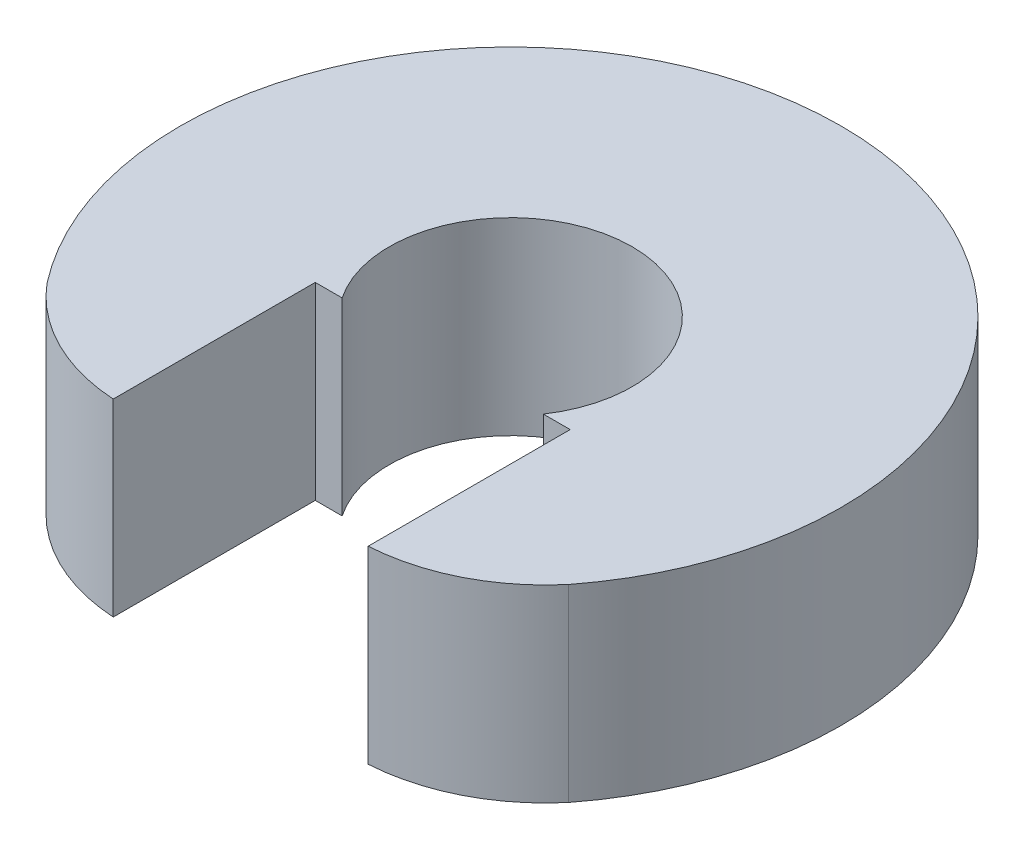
ISO-10303-21;
HEADER;
FILE_DESCRIPTION(('STEP AP214'),'2;1');
FILE_NAME('part.step','',(''),(''),'','','');
FILE_SCHEMA(('AUTOMOTIVE_DESIGN { 1 0 10303 214 1 1 1 1 }'));
ENDSEC;
DATA;
#1=APPLICATION_CONTEXT('core data for automotive mechanical design processes');
#2=APPLICATION_PROTOCOL_DEFINITION('international standard','automotive_design',2000,#1);
#3=PRODUCT_CONTEXT('',#1,'mechanical');
#4=PRODUCT('Part','Part','',(#3));
#5=PRODUCT_RELATED_PRODUCT_CATEGORY('part','',(#4));
#6=PRODUCT_DEFINITION_FORMATION('','',#4);
#7=PRODUCT_DEFINITION_CONTEXT('part definition',#1,'design');
#8=PRODUCT_DEFINITION('design','',#6,#7);
#9=PRODUCT_DEFINITION_SHAPE('','',#8);
#10=(LENGTH_UNIT() NAMED_UNIT(*) SI_UNIT(.MILLI.,.METRE.));
#11=(NAMED_UNIT(*) PLANE_ANGLE_UNIT() SI_UNIT($,.RADIAN.));
#12=(NAMED_UNIT(*) SI_UNIT($,.STERADIAN.) SOLID_ANGLE_UNIT());
#13=UNCERTAINTY_MEASURE_WITH_UNIT(LENGTH_MEASURE(1.E-05),#10,'distance_accuracy_value','');
#14=(GEOMETRIC_REPRESENTATION_CONTEXT(3) GLOBAL_UNCERTAINTY_ASSIGNED_CONTEXT((#13)) GLOBAL_UNIT_ASSIGNED_CONTEXT((#10,
#11,#12)) REPRESENTATION_CONTEXT('',''));
#15=CARTESIAN_POINT('',(0.,0.,0.));
#16=DIRECTION('',(0.,0.,1.));
#17=DIRECTION('',(1.,0.,0.));
#18=AXIS2_PLACEMENT_3D('',#15,#16,#17);
#19=CARTESIAN_POINT('',(0.,100.,0.));
#20=DIRECTION('',(0.,-1.,0.));
#21=DIRECTION('',(0.,0.,-1.));
#22=AXIS2_PLACEMENT_3D('',#19,#20,#21);
#23=CYLINDRICAL_SURFACE('',#22,175.);
#24=CARTESIAN_POINT('',(0.,0.,0.));
#25=DIRECTION('',(0.,1.,0.));
#26=DIRECTION('',(1.,0.,0.));
#27=AXIS2_PLACEMENT_3D('',#24,#25,#26);
#28=CIRCLE('',#27,175.);
#29=CARTESIAN_POINT('',(138.130006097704,0.,107.448133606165));
#30=VERTEX_POINT('',#29);
#31=CARTESIAN_POINT('',(-138.130006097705,0.,107.448133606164));
#32=VERTEX_POINT('',#31);
#33=EDGE_CURVE('E11',#30,#32,#28,.T.);
#34=ORIENTED_EDGE('',*,*,#33,.T.);
#35=DIRECTION('',(0.,-1.,0.));
#36=VECTOR('',#35,1.);
#37=CARTESIAN_POINT('',(-138.130006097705,100.,107.448133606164));
#38=LINE('',#37,#36);
#39=CARTESIAN_POINT('',(-138.130006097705,100.,107.448133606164));
#40=VERTEX_POINT('',#39);
#41=EDGE_CURVE('E39',#40,#32,#38,.T.);
#42=ORIENTED_EDGE('',*,*,#41,.F.);
#43=CARTESIAN_POINT('',(0.,100.,0.));
#44=DIRECTION('',(0.,1.,0.));
#45=DIRECTION('',(1.,0.,0.));
#46=AXIS2_PLACEMENT_3D('',#43,#44,#45);
#47=CIRCLE('',#46,175.);
#48=CARTESIAN_POINT('',(138.130006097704,100.,107.448133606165));
#49=VERTEX_POINT('',#48);
#50=EDGE_CURVE('E97',#49,#40,#47,.T.);
#51=ORIENTED_EDGE('',*,*,#50,.F.);
#52=DIRECTION('',(0.,-1.,0.));
#53=VECTOR('',#52,1.);
#54=CARTESIAN_POINT('',(138.130006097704,100.,107.448133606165));
#55=LINE('',#54,#53);
#56=EDGE_CURVE('E27',#49,#30,#55,.T.);
#57=ORIENTED_EDGE('',*,*,#56,.T.);
#58=EDGE_LOOP('',(#34,#42,#51,#57));
#59=FACE_BOUND('',#58,.T.);
#60=ADVANCED_FACE('F16',(#59),#23,.T.);
#61=CARTESIAN_POINT('',(-61.4364033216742,100.,43.0182327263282));
#62=DIRECTION('',(0.,-1.,0.));
#63=DIRECTION('',(0.,0.,-1.));
#64=AXIS2_PLACEMENT_3D('',#61,#62,#63);
#65=CYLINDRICAL_SURFACE('',#64,100.165467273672);
#66=CARTESIAN_POINT('',(-61.4364033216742,0.,43.0182327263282));
#67=DIRECTION('',(0.,1.,0.));
#68=DIRECTION('',(1.,0.,0.));
#69=AXIS2_PLACEMENT_3D('',#66,#67,#68);
#70=CIRCLE('',#69,100.165467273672);
#71=CARTESIAN_POINT('',(-67.5,0.,142.999999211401));
#72=VERTEX_POINT('',#71);
#73=EDGE_CURVE('E114',#32,#72,#70,.T.);
#74=ORIENTED_EDGE('',*,*,#73,.T.);
#75=DIRECTION('',(0.,-1.,0.));
#76=VECTOR('',#75,1.);
#77=CARTESIAN_POINT('',(-67.5,100.,142.999999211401));
#78=LINE('',#77,#76);
#79=CARTESIAN_POINT('',(-67.5,100.,142.999999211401));
#80=VERTEX_POINT('',#79);
#81=EDGE_CURVE('E139',#80,#72,#78,.T.);
#82=ORIENTED_EDGE('',*,*,#81,.F.);
#83=CARTESIAN_POINT('',(-61.4364033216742,100.,43.0182327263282));
#84=DIRECTION('',(0.,1.,0.));
#85=DIRECTION('',(1.,0.,0.));
#86=AXIS2_PLACEMENT_3D('',#83,#84,#85);
#87=CIRCLE('',#86,100.165467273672);
#88=EDGE_CURVE('E104',#40,#80,#87,.T.);
#89=ORIENTED_EDGE('',*,*,#88,.F.);
#90=ORIENTED_EDGE('',*,*,#41,.T.);
#91=EDGE_LOOP('',(#74,#82,#89,#90));
#92=FACE_BOUND('',#91,.T.);
#93=ADVANCED_FACE('F210',(#92),#65,.T.);
#94=CARTESIAN_POINT('',(-67.5,100.,142.999999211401));
#95=DIRECTION('',(-1.,0.,0.));
#96=DIRECTION('',(0.,0.,1.));
#97=AXIS2_PLACEMENT_3D('',#94,#95,#96);
#98=PLANE('',#97);
#99=DIRECTION('',(0.,0.,-1.));
#100=VECTOR('',#99,1.);
#101=CARTESIAN_POINT('',(-67.5,0.,142.999999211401));
#102=LINE('',#101,#100);
#103=CARTESIAN_POINT('',(-67.5,0.,36.));
#104=VERTEX_POINT('',#103);
#105=EDGE_CURVE('E140',#72,#104,#102,.T.);
#106=ORIENTED_EDGE('',*,*,#105,.T.);
#107=DIRECTION('',(0.,-1.,0.));
#108=VECTOR('',#107,1.);
#109=CARTESIAN_POINT('',(-67.5,100.,36.));
#110=LINE('',#109,#108);
#111=CARTESIAN_POINT('',(-67.5,100.,36.));
#112=VERTEX_POINT('',#111);
#113=EDGE_CURVE('E20',#112,#104,#110,.T.);
#114=ORIENTED_EDGE('',*,*,#113,.F.);
#115=DIRECTION('',(0.,0.,-1.));
#116=VECTOR('',#115,1.);
#117=CARTESIAN_POINT('',(-67.5,100.,142.999999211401));
#118=LINE('',#117,#116);
#119=EDGE_CURVE('E147',#80,#112,#118,.T.);
#120=ORIENTED_EDGE('',*,*,#119,.F.);
#121=ORIENTED_EDGE('',*,*,#81,.T.);
#122=EDGE_LOOP('',(#106,#114,#120,#121));
#123=FACE_BOUND('',#122,.T.);
#124=ADVANCED_FACE('F214',(#123),#98,.F.);
#125=CARTESIAN_POINT('',(-67.5,100.,36.));
#126=DIRECTION('',(0.,0.,-1.));
#127=DIRECTION('',(0.,-1.,0.));
#128=AXIS2_PLACEMENT_3D('',#125,#126,#127);
#129=PLANE('',#128);
#130=DIRECTION('',(1.,0.,0.));
#131=VECTOR('',#130,1.);
#132=CARTESIAN_POINT('',(-67.5,0.,36.));
#133=LINE('',#132,#131);
#134=CARTESIAN_POINT('',(-53.2774811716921,0.,36.));
#135=VERTEX_POINT('',#134);
#136=EDGE_CURVE('E135',#104,#135,#133,.T.);
#137=ORIENTED_EDGE('',*,*,#136,.T.);
#138=DIRECTION('',(0.,-1.,0.));
#139=VECTOR('',#138,1.);
#140=CARTESIAN_POINT('',(-53.2774811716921,100.,36.));
#141=LINE('',#140,#139);
#142=CARTESIAN_POINT('',(-53.2774811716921,100.,36.));
#143=VERTEX_POINT('',#142);
#144=EDGE_CURVE('E153',#143,#135,#141,.T.);
#145=ORIENTED_EDGE('',*,*,#144,.F.);
#146=DIRECTION('',(1.,0.,0.));
#147=VECTOR('',#146,1.);
#148=CARTESIAN_POINT('',(-67.5,100.,36.));
#149=LINE('',#148,#147);
#150=EDGE_CURVE('E144',#112,#143,#149,.T.);
#151=ORIENTED_EDGE('',*,*,#150,.F.);
#152=ORIENTED_EDGE('',*,*,#113,.T.);
#153=EDGE_LOOP('',(#137,#145,#151,#152));
#154=FACE_BOUND('',#153,.T.);
#155=ADVANCED_FACE('F217',(#154),#129,.F.);
#156=CARTESIAN_POINT('',(0.,100.,0.));
#157=DIRECTION('',(0.,-1.,0.));
#158=DIRECTION('',(0.,0.,-1.));
#159=AXIS2_PLACEMENT_3D('',#156,#157,#158);
#160=CYLINDRICAL_SURFACE('',#159,64.3);
#161=CARTESIAN_POINT('',(0.,0.,0.));
#162=DIRECTION('',(0.,1.,0.));
#163=DIRECTION('',(1.,0.,0.));
#164=AXIS2_PLACEMENT_3D('',#161,#162,#163);
#165=CIRCLE('',#164,64.3);
#166=CARTESIAN_POINT('',(53.277481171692,0.,36.));
#167=VERTEX_POINT('',#166);
#168=EDGE_CURVE('E120',#167,#135,#165,.T.);
#169=ORIENTED_EDGE('',*,*,#168,.F.);
#170=DIRECTION('',(0.,-1.,0.));
#171=VECTOR('',#170,1.);
#172=CARTESIAN_POINT('',(53.277481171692,100.,36.));
#173=LINE('',#172,#171);
#174=CARTESIAN_POINT('',(53.277481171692,100.,36.));
#175=VERTEX_POINT('',#174);
#176=EDGE_CURVE('E165',#175,#167,#173,.T.);
#177=ORIENTED_EDGE('',*,*,#176,.F.);
#178=CARTESIAN_POINT('',(0.,100.,0.));
#179=DIRECTION('',(0.,1.,0.));
#180=DIRECTION('',(1.,0.,0.));
#181=AXIS2_PLACEMENT_3D('',#178,#179,#180);
#182=CIRCLE('',#181,64.3);
#183=EDGE_CURVE('E150',#175,#143,#182,.T.);
#184=ORIENTED_EDGE('',*,*,#183,.T.);
#185=ORIENTED_EDGE('',*,*,#144,.T.);
#186=EDGE_LOOP('',(#169,#177,#184,#185));
#187=FACE_BOUND('',#186,.T.);
#188=ADVANCED_FACE('F218',(#187),#160,.F.);
#189=CARTESIAN_POINT('',(53.277481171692,100.,36.));
#190=DIRECTION('',(0.,0.,-1.));
#191=DIRECTION('',(0.,-1.,0.));
#192=AXIS2_PLACEMENT_3D('',#189,#190,#191);
#193=PLANE('',#192);
#194=DIRECTION('',(1.,0.,0.));
#195=VECTOR('',#194,1.);
#196=CARTESIAN_POINT('',(53.277481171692,0.,36.));
#197=LINE('',#196,#195);
#198=CARTESIAN_POINT('',(67.5,0.,36.));
#199=VERTEX_POINT('',#198);
#200=EDGE_CURVE('E133',#167,#199,#197,.T.);
#201=ORIENTED_EDGE('',*,*,#200,.T.);
#202=DIRECTION('',(0.,-1.,0.));
#203=VECTOR('',#202,1.);
#204=CARTESIAN_POINT('',(67.5,100.,36.));
#205=LINE('',#204,#203);
#206=CARTESIAN_POINT('',(67.5,100.,36.));
#207=VERTEX_POINT('',#206);
#208=EDGE_CURVE('E166',#207,#199,#205,.T.);
#209=ORIENTED_EDGE('',*,*,#208,.F.);
#210=DIRECTION('',(1.,0.,0.));
#211=VECTOR('',#210,1.);
#212=CARTESIAN_POINT('',(53.277481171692,100.,36.));
#213=LINE('',#212,#211);
#214=EDGE_CURVE('E127',#175,#207,#213,.T.);
#215=ORIENTED_EDGE('',*,*,#214,.F.);
#216=ORIENTED_EDGE('',*,*,#176,.T.);
#217=EDGE_LOOP('',(#201,#209,#215,#216));
#218=FACE_BOUND('',#217,.T.);
#219=ADVANCED_FACE('F176',(#218),#193,.F.);
#220=CARTESIAN_POINT('',(67.5,100.,36.));
#221=DIRECTION('',(1.,0.,0.));
#222=DIRECTION('',(0.,1.,0.));
#223=AXIS2_PLACEMENT_3D('',#220,#221,#222);
#224=PLANE('',#223);
#225=DIRECTION('',(0.,0.,1.));
#226=VECTOR('',#225,1.);
#227=CARTESIAN_POINT('',(67.5,0.,36.));
#228=LINE('',#227,#226);
#229=CARTESIAN_POINT('',(67.5,0.,142.999999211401));
#230=VERTEX_POINT('',#229);
#231=EDGE_CURVE('E161',#199,#230,#228,.T.);
#232=ORIENTED_EDGE('',*,*,#231,.T.);
#233=DIRECTION('',(0.,-1.,0.));
#234=VECTOR('',#233,1.);
#235=CARTESIAN_POINT('',(67.5,100.,142.999999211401));
#236=LINE('',#235,#234);
#237=CARTESIAN_POINT('',(67.5,100.,142.999999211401));
#238=VERTEX_POINT('',#237);
#239=EDGE_CURVE('E103',#238,#230,#236,.T.);
#240=ORIENTED_EDGE('',*,*,#239,.F.);
#241=DIRECTION('',(0.,0.,1.));
#242=VECTOR('',#241,1.);
#243=CARTESIAN_POINT('',(67.5,100.,36.));
#244=LINE('',#243,#242);
#245=EDGE_CURVE('E117',#207,#238,#244,.T.);
#246=ORIENTED_EDGE('',*,*,#245,.F.);
#247=ORIENTED_EDGE('',*,*,#208,.T.);
#248=EDGE_LOOP('',(#232,#240,#246,#247));
#249=FACE_BOUND('',#248,.T.);
#250=ADVANCED_FACE('F182',(#249),#224,.F.);
#251=CARTESIAN_POINT('',(61.4364033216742,100.,43.0182327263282));
#252=DIRECTION('',(0.,-1.,0.));
#253=DIRECTION('',(0.,0.,-1.));
#254=AXIS2_PLACEMENT_3D('',#251,#252,#253);
#255=CYLINDRICAL_SURFACE('',#254,100.165467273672);
#256=CARTESIAN_POINT('',(61.4364033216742,0.,43.0182327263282));
#257=DIRECTION('',(0.,1.,0.));
#258=DIRECTION('',(1.,0.,0.));
#259=AXIS2_PLACEMENT_3D('',#256,#257,#258);
#260=CIRCLE('',#259,100.165467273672);
#261=EDGE_CURVE('E112',#230,#30,#260,.T.);
#262=ORIENTED_EDGE('',*,*,#261,.T.);
#263=ORIENTED_EDGE('',*,*,#56,.F.);
#264=CARTESIAN_POINT('',(61.4364033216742,100.,43.0182327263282));
#265=DIRECTION('',(0.,1.,0.));
#266=DIRECTION('',(1.,0.,0.));
#267=AXIS2_PLACEMENT_3D('',#264,#265,#266);
#268=CIRCLE('',#267,100.165467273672);
#269=EDGE_CURVE('E110',#238,#49,#268,.T.);
#270=ORIENTED_EDGE('',*,*,#269,.F.);
#271=ORIENTED_EDGE('',*,*,#239,.T.);
#272=EDGE_LOOP('',(#262,#263,#270,#271));
#273=FACE_BOUND('',#272,.T.);
#274=ADVANCED_FACE('F109',(#273),#255,.T.);
#275=CARTESIAN_POINT('',(0.,100.,0.));
#276=DIRECTION('',(0.,1.,0.));
#277=DIRECTION('',(1.,0.,0.));
#278=AXIS2_PLACEMENT_3D('',#275,#276,#277);
#279=PLANE('',#278);
#280=ORIENTED_EDGE('',*,*,#50,.T.);
#281=ORIENTED_EDGE('',*,*,#88,.T.);
#282=ORIENTED_EDGE('',*,*,#119,.T.);
#283=ORIENTED_EDGE('',*,*,#150,.T.);
#284=ORIENTED_EDGE('',*,*,#183,.F.);
#285=ORIENTED_EDGE('',*,*,#214,.T.);
#286=ORIENTED_EDGE('',*,*,#245,.T.);
#287=ORIENTED_EDGE('',*,*,#269,.T.);
#288=EDGE_LOOP('',(#280,#281,#282,#283,#284,#285,#286,#287));
#289=FACE_BOUND('',#288,.T.);
#290=ADVANCED_FACE('F18',(#289),#279,.T.);
#291=CARTESIAN_POINT('',(0.,0.,0.));
#292=DIRECTION('',(0.,1.,0.));
#293=DIRECTION('',(1.,0.,0.));
#294=AXIS2_PLACEMENT_3D('',#291,#292,#293);
#295=PLANE('',#294);
#296=ORIENTED_EDGE('',*,*,#33,.F.);
#297=ORIENTED_EDGE('',*,*,#261,.F.);
#298=ORIENTED_EDGE('',*,*,#231,.F.);
#299=ORIENTED_EDGE('',*,*,#200,.F.);
#300=ORIENTED_EDGE('',*,*,#168,.T.);
#301=ORIENTED_EDGE('',*,*,#136,.F.);
#302=ORIENTED_EDGE('',*,*,#105,.F.);
#303=ORIENTED_EDGE('',*,*,#73,.F.);
#304=EDGE_LOOP('',(#296,#297,#298,#299,#300,#301,#302,#303));
#305=FACE_BOUND('',#304,.T.);
#306=ADVANCED_FACE('F205',(#305),#295,.F.);
#307=CLOSED_SHELL('',(#60,#93,#124,#155,#188,#219,#250,#274,#290,#306));
#308=MANIFOLD_SOLID_BREP('B1',#307);
#309=ADVANCED_BREP_SHAPE_REPRESENTATION('',(#18,#308),#14);
#310=SHAPE_DEFINITION_REPRESENTATION(#9,#309);
ENDSEC;
END-ISO-10303-21;
